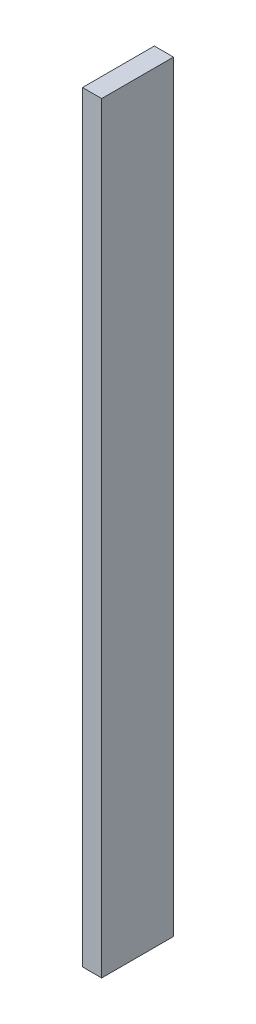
ISO-10303-21;
HEADER;
FILE_DESCRIPTION(('STEP AP214'),'2;1');
FILE_NAME('part.step','',(''),(''),'','','');
FILE_SCHEMA(('AUTOMOTIVE_DESIGN { 1 0 10303 214 1 1 1 1 }'));
ENDSEC;
DATA;
#1=APPLICATION_CONTEXT('core data for automotive mechanical design processes');
#2=APPLICATION_PROTOCOL_DEFINITION('international standard','automotive_design',2000,#1);
#3=PRODUCT_CONTEXT('',#1,'mechanical');
#4=PRODUCT('Part','Part','',(#3));
#5=PRODUCT_RELATED_PRODUCT_CATEGORY('part','',(#4));
#6=PRODUCT_DEFINITION_FORMATION('','',#4);
#7=PRODUCT_DEFINITION_CONTEXT('part definition',#1,'design');
#8=PRODUCT_DEFINITION('design','',#6,#7);
#9=PRODUCT_DEFINITION_SHAPE('','',#8);
#10=(LENGTH_UNIT() NAMED_UNIT(*) SI_UNIT(.MILLI.,.METRE.));
#11=(NAMED_UNIT(*) PLANE_ANGLE_UNIT() SI_UNIT($,.RADIAN.));
#12=(NAMED_UNIT(*) SI_UNIT($,.STERADIAN.) SOLID_ANGLE_UNIT());
#13=UNCERTAINTY_MEASURE_WITH_UNIT(LENGTH_MEASURE(1.E-05),#10,'distance_accuracy_value','');
#14=(GEOMETRIC_REPRESENTATION_CONTEXT(3) GLOBAL_UNCERTAINTY_ASSIGNED_CONTEXT((#13)) GLOBAL_UNIT_ASSIGNED_CONTEXT((#10,
#11,#12)) REPRESENTATION_CONTEXT('',''));
#15=CARTESIAN_POINT('',(0.,0.,0.));
#16=DIRECTION('',(0.,0.,1.));
#17=DIRECTION('',(1.,0.,0.));
#18=AXIS2_PLACEMENT_3D('',#15,#16,#17);
#19=CARTESIAN_POINT('',(3.89999999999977,79.5,15.));
#20=DIRECTION('',(0.,0.,-1.));
#21=DIRECTION('',(-1.,0.,0.));
#22=AXIS2_PLACEMENT_3D('',#19,#20,#21);
#23=PLANE('',#22);
#24=DIRECTION('',(-1.,0.,0.));
#25=VECTOR('',#24,1.);
#26=CARTESIAN_POINT('',(3.90000000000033,-79.5,15.));
#27=LINE('',#26,#25);
#28=CARTESIAN_POINT('',(4.00000000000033,-79.5,15.));
#29=VERTEX_POINT('',#28);
#30=CARTESIAN_POINT('',(3.29380620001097E-13,-79.5,15.));
#31=VERTEX_POINT('',#30);
#32=EDGE_CURVE('E10',#29,#31,#27,.T.);
#33=ORIENTED_EDGE('',*,*,#32,.F.);
#34=DIRECTION('',(0.,-1.,0.));
#35=VECTOR('',#34,1.);
#36=CARTESIAN_POINT('',(3.99999999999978,79.5,15.));
#37=LINE('',#36,#35);
#38=CARTESIAN_POINT('',(3.99999999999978,79.5,15.));
#39=VERTEX_POINT('',#38);
#40=EDGE_CURVE('E79',#39,#29,#37,.T.);
#41=ORIENTED_EDGE('',*,*,#40,.F.);
#42=DIRECTION('',(-1.,0.,0.));
#43=VECTOR('',#42,1.);
#44=CARTESIAN_POINT('',(3.89999999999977,79.5,15.));
#45=LINE('',#44,#43);
#46=CARTESIAN_POINT('',(-2.25730892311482E-13,79.5,15.));
#47=VERTEX_POINT('',#46);
#48=EDGE_CURVE('E37',#39,#47,#45,.T.);
#49=ORIENTED_EDGE('',*,*,#48,.T.);
#50=DIRECTION('',(0.,-1.,0.));
#51=VECTOR('',#50,1.);
#52=CARTESIAN_POINT('',(-2.25514051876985E-13,79.5,15.));
#53=LINE('',#52,#51);
#54=EDGE_CURVE('E81',#31,#47,#53,.F.);
#55=ORIENTED_EDGE('',*,*,#54,.F.);
#56=EDGE_LOOP('',(#33,#41,#49,#55));
#57=FACE_BOUND('',#56,.T.);
#58=ADVANCED_FACE('F16',(#57),#23,.F.);
#59=CARTESIAN_POINT('',(3.90000000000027,-79.5,0.));
#60=DIRECTION('',(0.,1.,0.));
#61=DIRECTION('',(-1.,0.,0.));
#62=AXIS2_PLACEMENT_3D('',#59,#60,#61);
#63=PLANE('',#62);
#64=DIRECTION('',(1.,0.,0.));
#65=VECTOR('',#64,1.);
#66=CARTESIAN_POINT('',(3.90000000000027,-79.5,0.));
#67=LINE('',#66,#65);
#68=CARTESIAN_POINT('',(2.75170511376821E-13,-79.5,0.));
#69=VERTEX_POINT('',#68);
#70=CARTESIAN_POINT('',(4.00000000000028,-79.5,0.));
#71=VERTEX_POINT('',#70);
#72=EDGE_CURVE('E24',#69,#71,#67,.T.);
#73=ORIENTED_EDGE('',*,*,#72,.T.);
#74=DIRECTION('',(0.,0.,-1.));
#75=VECTOR('',#74,1.);
#76=CARTESIAN_POINT('',(4.00000000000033,-79.5,15.));
#77=LINE('',#76,#75);
#78=EDGE_CURVE('E83',#29,#71,#77,.T.);
#79=ORIENTED_EDGE('',*,*,#78,.F.);
#80=ORIENTED_EDGE('',*,*,#32,.T.);
#81=DIRECTION('',(0.,0.,-1.));
#82=VECTOR('',#81,1.);
#83=CARTESIAN_POINT('',(2.75387351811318E-13,-79.5,0.));
#84=LINE('',#83,#82);
#85=EDGE_CURVE('E137',#31,#69,#84,.T.);
#86=ORIENTED_EDGE('',*,*,#85,.T.);
#87=EDGE_LOOP('',(#73,#79,#80,#86));
#88=FACE_BOUND('',#87,.T.);
#89=ADVANCED_FACE('F84',(#88),#63,.F.);
#90=CARTESIAN_POINT('',(-2.25730892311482E-13,79.5,15.));
#91=DIRECTION('',(1.,0.,0.));
#92=DIRECTION('',(0.,0.,-1.));
#93=AXIS2_PLACEMENT_3D('',#90,#91,#92);
#94=PLANE('',#93);
#95=ORIENTED_EDGE('',*,*,#85,.F.);
#96=ORIENTED_EDGE('',*,*,#54,.T.);
#97=DIRECTION('',(0.,0.,-1.));
#98=VECTOR('',#97,1.);
#99=CARTESIAN_POINT('',(-2.7972416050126E-13,79.5,0.));
#100=LINE('',#99,#98);
#101=CARTESIAN_POINT('',(-2.79941000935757E-13,79.5,0.));
#102=VERTEX_POINT('',#101);
#103=EDGE_CURVE('E132',#47,#102,#100,.T.);
#104=ORIENTED_EDGE('',*,*,#103,.T.);
#105=DIRECTION('',(0.,1.,0.));
#106=VECTOR('',#105,1.);
#107=CARTESIAN_POINT('',(2.76254713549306E-13,-79.7828427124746,0.));
#108=LINE('',#107,#106);
#109=CARTESIAN_POINT('',(-1.70002900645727E-13,48.,0.));
#110=VERTEX_POINT('',#109);
#111=EDGE_CURVE('E98',#110,#102,#108,.T.);
#112=ORIENTED_EDGE('',*,*,#111,.F.);
#113=DIRECTION('',(0.,0.,-1.));
#114=VECTOR('',#113,1.);
#115=CARTESIAN_POINT('',(-1.15792792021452E-13,48.,15.));
#116=LINE('',#115,#114);
#117=CARTESIAN_POINT('',(-1.48318857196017E-13,48.,6.));
#118=VERTEX_POINT('',#117);
#119=EDGE_CURVE('E103',#118,#110,#116,.T.);
#120=ORIENTED_EDGE('',*,*,#119,.F.);
#121=DIRECTION('',(0.,1.,0.));
#122=VECTOR('',#121,1.);
#123=CARTESIAN_POINT('',(-2.5804011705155E-13,79.5,6.));
#124=LINE('',#123,#122);
#125=CARTESIAN_POINT('',(1.87133294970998E-13,-48.,6.));
#126=VERTEX_POINT('',#125);
#127=EDGE_CURVE('E105',#126,#118,#124,.T.);
#128=ORIENTED_EDGE('',*,*,#127,.F.);
#129=DIRECTION('',(0.,0.,-1.));
#130=VECTOR('',#129,1.);
#131=CARTESIAN_POINT('',(2.19442519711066E-13,-48.,15.));
#132=LINE('',#131,#130);
#133=CARTESIAN_POINT('',(1.65232411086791E-13,-48.,0.));
#134=VERTEX_POINT('',#133);
#135=EDGE_CURVE('E108',#134,#126,#132,.F.);
#136=ORIENTED_EDGE('',*,*,#135,.F.);
#137=EDGE_CURVE('E99',#69,#134,#108,.T.);
#138=ORIENTED_EDGE('',*,*,#137,.F.);
#139=EDGE_LOOP('',(#95,#96,#104,#112,#120,#128,#136,#138));
#140=FACE_BOUND('',#139,.T.);
#141=ADVANCED_FACE('F18',(#140),#94,.F.);
#142=CARTESIAN_POINT('',(3.89999999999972,79.5,0.));
#143=DIRECTION('',(0.,1.,0.));
#144=DIRECTION('',(-1.,0.,0.));
#145=AXIS2_PLACEMENT_3D('',#142,#143,#144);
#146=PLANE('',#145);
#147=ORIENTED_EDGE('',*,*,#48,.F.);
#148=DIRECTION('',(0.,0.,1.));
#149=VECTOR('',#148,1.);
#150=CARTESIAN_POINT('',(3.99999999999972,79.5,0.));
#151=LINE('',#150,#149);
#152=CARTESIAN_POINT('',(3.99999999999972,79.5,0.));
#153=VERTEX_POINT('',#152);
#154=EDGE_CURVE('E93',#153,#39,#151,.T.);
#155=ORIENTED_EDGE('',*,*,#154,.F.);
#156=DIRECTION('',(1.,0.,0.));
#157=VECTOR('',#156,1.);
#158=CARTESIAN_POINT('',(3.89999999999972,79.5,0.));
#159=LINE('',#158,#157);
#160=EDGE_CURVE('E134',#102,#153,#159,.T.);
#161=ORIENTED_EDGE('',*,*,#160,.F.);
#162=ORIENTED_EDGE('',*,*,#103,.F.);
#163=EDGE_LOOP('',(#147,#155,#161,#162));
#164=FACE_BOUND('',#163,.T.);
#165=ADVANCED_FACE('F161',(#164),#146,.T.);
#166=CARTESIAN_POINT('',(-6.,0.,7.5));
#167=DIRECTION('',(-1.,0.,0.));
#168=DIRECTION('',(0.,0.,1.));
#169=AXIS2_PLACEMENT_3D('',#166,#167,#168);
#170=PLANE('',#169);
#171=DIRECTION('',(0.,0.,1.));
#172=VECTOR('',#171,1.);
#173=CARTESIAN_POINT('',(-5.99999999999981,-48.,6.));
#174=LINE('',#173,#172);
#175=CARTESIAN_POINT('',(-5.99999999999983,-48.,0.));
#176=VERTEX_POINT('',#175);
#177=CARTESIAN_POINT('',(-5.99999999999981,-48.,6.));
#178=VERTEX_POINT('',#177);
#179=EDGE_CURVE('E125',#176,#178,#174,.T.);
#180=ORIENTED_EDGE('',*,*,#179,.T.);
#181=DIRECTION('',(0.,1.,0.));
#182=VECTOR('',#181,1.);
#183=CARTESIAN_POINT('',(-6.00000000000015,48.,6.));
#184=LINE('',#183,#182);
#185=CARTESIAN_POINT('',(-6.00000000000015,48.,6.));
#186=VERTEX_POINT('',#185);
#187=EDGE_CURVE('E120',#178,#186,#184,.T.);
#188=ORIENTED_EDGE('',*,*,#187,.T.);
#189=DIRECTION('',(0.,0.,-1.));
#190=VECTOR('',#189,1.);
#191=CARTESIAN_POINT('',(-6.00000000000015,48.,6.));
#192=LINE('',#191,#190);
#193=CARTESIAN_POINT('',(-6.00000000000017,48.,0.));
#194=VERTEX_POINT('',#193);
#195=EDGE_CURVE('E114',#186,#194,#192,.T.);
#196=ORIENTED_EDGE('',*,*,#195,.T.);
#197=DIRECTION('',(0.,1.,0.));
#198=VECTOR('',#197,1.);
#199=CARTESIAN_POINT('',(-6.00000000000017,48.,0.));
#200=LINE('',#199,#198);
#201=EDGE_CURVE('E102',#194,#176,#200,.F.);
#202=ORIENTED_EDGE('',*,*,#201,.T.);
#203=EDGE_LOOP('',(#180,#188,#196,#202));
#204=FACE_BOUND('',#203,.T.);
#205=ADVANCED_FACE('F149',(#204),#170,.T.);
#206=CARTESIAN_POINT('',(-6.00000000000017,48.,0.));
#207=DIRECTION('',(0.,0.,1.));
#208=DIRECTION('',(1.,0.,0.));
#209=AXIS2_PLACEMENT_3D('',#206,#207,#208);
#210=PLANE('',#209);
#211=DIRECTION('',(-1.,0.,0.));
#212=VECTOR('',#211,1.);
#213=CARTESIAN_POINT('',(-5.99999999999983,-48.,0.));
#214=LINE('',#213,#212);
#215=EDGE_CURVE('E127',#134,#176,#214,.T.);
#216=ORIENTED_EDGE('',*,*,#215,.T.);
#217=ORIENTED_EDGE('',*,*,#201,.F.);
#218=DIRECTION('',(1.,0.,0.));
#219=VECTOR('',#218,1.);
#220=CARTESIAN_POINT('',(-6.00000000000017,48.,0.));
#221=LINE('',#220,#219);
#222=EDGE_CURVE('E111',#194,#110,#221,.T.);
#223=ORIENTED_EDGE('',*,*,#222,.T.);
#224=ORIENTED_EDGE('',*,*,#111,.T.);
#225=ORIENTED_EDGE('',*,*,#160,.T.);
#226=DIRECTION('',(0.,1.,0.));
#227=VECTOR('',#226,1.);
#228=CARTESIAN_POINT('',(4.00000000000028,-79.5,0.));
#229=LINE('',#228,#227);
#230=EDGE_CURVE('E88',#71,#153,#229,.T.);
#231=ORIENTED_EDGE('',*,*,#230,.F.);
#232=ORIENTED_EDGE('',*,*,#72,.F.);
#233=ORIENTED_EDGE('',*,*,#137,.T.);
#234=EDGE_LOOP('',(#216,#217,#223,#224,#225,#231,#232,#233));
#235=FACE_BOUND('',#234,.T.);
#236=ADVANCED_FACE('F143',(#235),#210,.F.);
#237=CARTESIAN_POINT('',(-5.99999999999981,-48.,6.));
#238=DIRECTION('',(0.,1.,0.));
#239=DIRECTION('',(-1.,0.,0.));
#240=AXIS2_PLACEMENT_3D('',#237,#238,#239);
#241=PLANE('',#240);
#242=ORIENTED_EDGE('',*,*,#135,.T.);
#243=DIRECTION('',(-1.,0.,0.));
#244=VECTOR('',#243,1.);
#245=CARTESIAN_POINT('',(-5.99999999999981,-48.,6.));
#246=LINE('',#245,#244);
#247=EDGE_CURVE('E122',#126,#178,#246,.T.);
#248=ORIENTED_EDGE('',*,*,#247,.T.);
#249=ORIENTED_EDGE('',*,*,#179,.F.);
#250=ORIENTED_EDGE('',*,*,#215,.F.);
#251=EDGE_LOOP('',(#242,#248,#249,#250));
#252=FACE_BOUND('',#251,.T.);
#253=ADVANCED_FACE('F146',(#252),#241,.F.);
#254=CARTESIAN_POINT('',(-6.00000000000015,48.,6.));
#255=DIRECTION('',(0.,0.,-1.));
#256=DIRECTION('',(-1.,0.,0.));
#257=AXIS2_PLACEMENT_3D('',#254,#255,#256);
#258=PLANE('',#257);
#259=DIRECTION('',(1.,0.,0.));
#260=VECTOR('',#259,1.);
#261=CARTESIAN_POINT('',(-6.00000000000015,48.,6.));
#262=LINE('',#261,#260);
#263=EDGE_CURVE('E117',#118,#186,#262,.F.);
#264=ORIENTED_EDGE('',*,*,#263,.T.);
#265=ORIENTED_EDGE('',*,*,#187,.F.);
#266=ORIENTED_EDGE('',*,*,#247,.F.);
#267=ORIENTED_EDGE('',*,*,#127,.T.);
#268=EDGE_LOOP('',(#264,#265,#266,#267));
#269=FACE_BOUND('',#268,.T.);
#270=ADVANCED_FACE('F152',(#269),#258,.F.);
#271=CARTESIAN_POINT('',(-6.00000000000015,48.,6.));
#272=DIRECTION('',(0.,-1.,0.));
#273=DIRECTION('',(0.,0.,-1.));
#274=AXIS2_PLACEMENT_3D('',#271,#272,#273);
#275=PLANE('',#274);
#276=ORIENTED_EDGE('',*,*,#119,.T.);
#277=ORIENTED_EDGE('',*,*,#222,.F.);
#278=ORIENTED_EDGE('',*,*,#195,.F.);
#279=ORIENTED_EDGE('',*,*,#263,.F.);
#280=EDGE_LOOP('',(#276,#277,#278,#279));
#281=FACE_BOUND('',#280,.T.);
#282=ADVANCED_FACE('F155',(#281),#275,.F.);
#283=CARTESIAN_POINT('',(4.,0.,0.));
#284=DIRECTION('',(1.,0.,0.));
#285=DIRECTION('',(0.,0.,-1.));
#286=AXIS2_PLACEMENT_3D('',#283,#284,#285);
#287=PLANE('',#286);
#288=ORIENTED_EDGE('',*,*,#40,.T.);
#289=ORIENTED_EDGE('',*,*,#78,.T.);
#290=ORIENTED_EDGE('',*,*,#230,.T.);
#291=ORIENTED_EDGE('',*,*,#154,.T.);
#292=EDGE_LOOP('',(#288,#289,#290,#291));
#293=FACE_BOUND('',#292,.T.);
#294=ADVANCED_FACE('F91',(#293),#287,.T.);
#295=CLOSED_SHELL('',(#58,#89,#141,#165,#205,#236,#253,#270,#282,#294));
#296=MANIFOLD_SOLID_BREP('B1',#295);
#297=ADVANCED_BREP_SHAPE_REPRESENTATION('',(#18,#296),#14);
#298=SHAPE_DEFINITION_REPRESENTATION(#9,#297);
ENDSEC;
END-ISO-10303-21;
